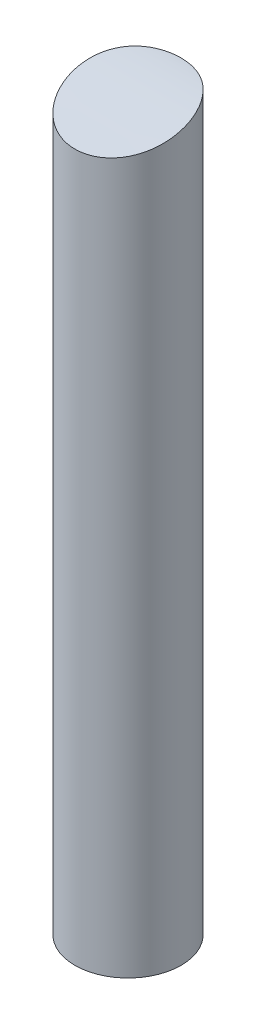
ISO-10303-21;
HEADER;
FILE_DESCRIPTION(('STEP AP214'),'2;1');
FILE_NAME('part.step','',(''),(''),'','','');
FILE_SCHEMA(('AUTOMOTIVE_DESIGN { 1 0 10303 214 1 1 1 1 }'));
ENDSEC;
DATA;
#1=APPLICATION_CONTEXT('core data for automotive mechanical design processes');
#2=APPLICATION_PROTOCOL_DEFINITION('international standard','automotive_design',2000,#1);
#3=PRODUCT_CONTEXT('',#1,'mechanical');
#4=PRODUCT('Part','Part','',(#3));
#5=PRODUCT_RELATED_PRODUCT_CATEGORY('part','',(#4));
#6=PRODUCT_DEFINITION_FORMATION('','',#4);
#7=PRODUCT_DEFINITION_CONTEXT('part definition',#1,'design');
#8=PRODUCT_DEFINITION('design','',#6,#7);
#9=PRODUCT_DEFINITION_SHAPE('','',#8);
#10=(LENGTH_UNIT() NAMED_UNIT(*) SI_UNIT(.MILLI.,.METRE.));
#11=(NAMED_UNIT(*) PLANE_ANGLE_UNIT() SI_UNIT($,.RADIAN.));
#12=(NAMED_UNIT(*) SI_UNIT($,.STERADIAN.) SOLID_ANGLE_UNIT());
#13=UNCERTAINTY_MEASURE_WITH_UNIT(LENGTH_MEASURE(1.E-05),#10,'distance_accuracy_value','');
#14=(GEOMETRIC_REPRESENTATION_CONTEXT(3) GLOBAL_UNCERTAINTY_ASSIGNED_CONTEXT((#13)) GLOBAL_UNIT_ASSIGNED_CONTEXT((#10,
#11,#12)) REPRESENTATION_CONTEXT('',''));
#15=CARTESIAN_POINT('',(0.,0.,0.));
#16=DIRECTION('',(0.,0.,1.));
#17=DIRECTION('',(1.,0.,0.));
#18=AXIS2_PLACEMENT_3D('',#15,#16,#17);
#19=CARTESIAN_POINT('',(0.,15.,0.));
#20=DIRECTION('',(0.,-1.,0.));
#21=DIRECTION('',(0.,0.,-1.));
#22=AXIS2_PLACEMENT_3D('',#19,#20,#21);
#23=CYLINDRICAL_SURFACE('',#22,1.);
#24=CARTESIAN_POINT('',(0.,13.7894850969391,-1.));
#25=CARTESIAN_POINT('',(0.0560713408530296,13.7894883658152,-0.999997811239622));
#26=CARTESIAN_POINT('',(0.112173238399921,13.7896945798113,-0.99526919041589));
#27=CARTESIAN_POINT('',(0.222832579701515,13.7901983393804,-0.976473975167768));
#28=CARTESIAN_POINT('',(0.27738837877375,13.7904959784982,-0.962397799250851));
#29=CARTESIAN_POINT('',(0.383381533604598,13.7903457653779,-0.925294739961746));
#30=CARTESIAN_POINT('',(0.434818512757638,13.789897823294,-0.902266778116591));
#31=CARTESIAN_POINT('',(0.53305421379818,13.7872726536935,-0.847939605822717));
#32=CARTESIAN_POINT('',(0.579854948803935,13.7850961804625,-0.816644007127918));
#33=CARTESIAN_POINT('',(0.666905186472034,13.7782599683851,-0.747194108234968));
#34=CARTESIAN_POINT('',(0.707228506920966,13.7736312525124,-0.709129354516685));
#35=CARTESIAN_POINT('',(0.78086200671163,13.7615178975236,-0.62712908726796));
#36=CARTESIAN_POINT('',(0.814172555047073,13.7540334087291,-0.583193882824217));
#37=CARTESIAN_POINT('',(0.872411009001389,13.7363988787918,-0.491718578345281));
#38=CARTESIAN_POINT('',(0.897479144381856,13.7262992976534,-0.444257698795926));
#39=CARTESIAN_POINT('',(0.939585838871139,13.7037278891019,-0.346433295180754));
#40=CARTESIAN_POINT('',(0.956622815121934,13.6912555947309,-0.296069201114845));
#41=CARTESIAN_POINT('',(0.982935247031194,13.6640181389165,-0.191904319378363));
#42=CARTESIAN_POINT('',(0.991909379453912,13.6491866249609,-0.138045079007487));
#43=CARTESIAN_POINT('',(1.00103232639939,13.618289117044,-0.0298339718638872));
#44=CARTESIAN_POINT('',(1.00116331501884,13.6022206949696,0.0245186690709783));
#45=CARTESIAN_POINT('',(0.992404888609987,13.5686213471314,0.135784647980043));
#46=CARTESIAN_POINT('',(0.982950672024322,13.5510618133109,0.192645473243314));
#47=CARTESIAN_POINT('',(0.954423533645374,13.5163665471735,0.303923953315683));
#48=CARTESIAN_POINT('',(0.935366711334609,13.499230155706,0.358345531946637));
#49=CARTESIAN_POINT('',(0.887502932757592,13.465798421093,0.464544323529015));
#50=CARTESIAN_POINT('',(0.858495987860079,13.4495289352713,0.516239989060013));
#51=CARTESIAN_POINT('',(0.791466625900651,13.418968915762,0.614080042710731));
#52=CARTESIAN_POINT('',(0.753446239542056,13.4046779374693,0.660225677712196));
#53=CARTESIAN_POINT('',(0.670892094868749,13.3791014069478,0.743791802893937));
#54=CARTESIAN_POINT('',(0.626647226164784,13.3677250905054,0.781469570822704));
#55=CARTESIAN_POINT('',(0.531889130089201,13.3476447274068,0.848804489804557));
#56=CARTESIAN_POINT('',(0.481377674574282,13.3389399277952,0.878463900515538));
#57=CARTESIAN_POINT('',(0.378207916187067,13.3247301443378,0.927393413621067));
#58=CARTESIAN_POINT('',(0.325775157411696,13.3190895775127,0.947100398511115));
#59=CARTESIAN_POINT('',(0.218155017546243,13.3104383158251,0.977513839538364));
#60=CARTESIAN_POINT('',(0.162968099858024,13.3074271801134,0.988221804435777));
#61=CARTESIAN_POINT('',(0.0530491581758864,13.3040958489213,1.00007869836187));
#62=CARTESIAN_POINT('',(-0.00165320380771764,13.3037035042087,1.00148391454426));
#63=CARTESIAN_POINT('',(-0.110514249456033,13.3054189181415,0.995368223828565));
#64=CARTESIAN_POINT('',(-0.164672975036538,13.3075264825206,0.987848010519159));
#65=CARTESIAN_POINT('',(-0.270555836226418,13.3142123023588,0.964221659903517));
#66=CARTESIAN_POINT('',(-0.322293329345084,13.3187746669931,0.948170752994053));
#67=CARTESIAN_POINT('',(-0.42227308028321,13.3303239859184,0.908067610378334));
#68=CARTESIAN_POINT('',(-0.470515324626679,13.3373109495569,0.884015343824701));
#69=CARTESIAN_POINT('',(-0.562734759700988,13.3537011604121,0.828408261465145));
#70=CARTESIAN_POINT('',(-0.606659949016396,13.3631298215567,0.796774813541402));
#71=CARTESIAN_POINT('',(-0.688557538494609,13.3841654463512,0.727171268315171));
#72=CARTESIAN_POINT('',(-0.726529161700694,13.395772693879,0.689200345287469));
#73=CARTESIAN_POINT('',(-0.796782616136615,13.4212439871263,0.606764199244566));
#74=CARTESIAN_POINT('',(-0.828845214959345,13.435168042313,0.562130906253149));
#75=CARTESIAN_POINT('',(-0.885096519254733,13.4645075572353,0.468598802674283));
#76=CARTESIAN_POINT('',(-0.909283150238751,13.4799234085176,0.41969887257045));
#77=CARTESIAN_POINT('',(-0.950311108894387,13.5124053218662,0.316450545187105));
#78=CARTESIAN_POINT('',(-0.966743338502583,13.5295150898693,0.261953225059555));
#79=CARTESIAN_POINT('',(-0.990178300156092,13.5639407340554,0.150912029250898));
#80=CARTESIAN_POINT('',(-0.997161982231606,13.5812569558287,0.0943642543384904));
#81=CARTESIAN_POINT('',(-1.00150088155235,13.6157596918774,-0.0212185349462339));
#82=CARTESIAN_POINT('',(-0.998526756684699,13.6329225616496,-0.0802735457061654));
#83=CARTESIAN_POINT('',(-0.982119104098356,13.6654832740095,-0.19729085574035));
#84=CARTESIAN_POINT('',(-0.968707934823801,13.6808848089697,-0.255255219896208));
#85=CARTESIAN_POINT('',(-0.932008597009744,13.7087111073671,-0.367062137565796));
#86=CARTESIAN_POINT('',(-0.908973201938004,13.7212001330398,-0.420971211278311));
#87=CARTESIAN_POINT('',(-0.85349260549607,13.743045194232,-0.524393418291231));
#88=CARTESIAN_POINT('',(-0.821052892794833,13.7524030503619,-0.573909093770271));
#89=CARTESIAN_POINT('',(-0.749998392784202,13.767268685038,-0.663754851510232));
#90=CARTESIAN_POINT('',(-0.711913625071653,13.7729850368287,-0.704470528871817));
#91=CARTESIAN_POINT('',(-0.629325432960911,13.7817223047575,-0.779132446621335));
#92=CARTESIAN_POINT('',(-0.584821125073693,13.7847428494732,-0.813077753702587));
#93=CARTESIAN_POINT('',(-0.491852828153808,13.7886955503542,-0.87238207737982));
#94=CARTESIAN_POINT('',(-0.443508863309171,13.789675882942,-0.897926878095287));
#95=CARTESIAN_POINT('',(-0.343328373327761,13.7905615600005,-0.940792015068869));
#96=CARTESIAN_POINT('',(-0.291494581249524,13.790467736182,-0.958118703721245));
#97=CARTESIAN_POINT('',(-0.199616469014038,13.7901108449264,-0.980698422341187));
#98=CARTESIAN_POINT('',(-0.160044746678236,13.7898986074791,-0.987926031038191));
#99=CARTESIAN_POINT('',(-0.0803205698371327,13.789584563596,-0.997577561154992));
#100=CARTESIAN_POINT('',(-0.0401681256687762,13.7894827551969,-1.00000156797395));
#101=CARTESIAN_POINT('',(0.,13.7894850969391,-1.));
#102=B_SPLINE_CURVE_WITH_KNOTS('',3,(#24,#25,#26,#27,#28,#29,#30,#31,#32,#33,#34,#35,#36,#37,
#38,#39,#40,#41,#42,#43,#44,#45,#46,#47,#48,#49,#50,#51,#52,#53,#54,#55,#56,#57,#58,#59,#60,#61,
#62,#63,#64,#65,#66,#67,#68,#69,#70,#71,#72,#73,#74,#75,#76,#77,#78,#79,#80,#81,#82,#83,#84,#85,
#86,#87,#88,#89,#90,#91,#92,#93,#94,#95,#96,#97,#98,#99,#100,#101),.UNSPECIFIED.,.T.,.F.,(4,2,2,
2,2,2,2,2,2,2,2,2,2,2,2,2,2,2,2,2,2,2,2,2,2,2,2,2,2,2,2,2,2,2,2,2,2,2,4),(0.,0.168069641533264,
0.336311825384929,0.504574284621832,0.672763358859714,0.838873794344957,1.00497548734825,
1.16808423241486,1.33122511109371,1.50023594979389,1.66958746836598,1.849533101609,
2.02917804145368,2.21266865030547,2.39611795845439,2.57286151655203,2.7495552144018,
2.91761408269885,3.08564476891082,3.24902629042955,3.41239511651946,3.5747189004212,
3.73704331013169,3.90113035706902,4.06523880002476,4.23456383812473,4.40393343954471,
4.581446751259,4.7593174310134,4.94312829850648,5.12654648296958,5.3054232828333,
5.4841958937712,5.65149346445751,5.81881408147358,5.98213665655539,6.14533278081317,
6.26573586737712,6.3861368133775),.UNSPECIFIED.);
#103=CARTESIAN_POINT('',(0.,13.7894850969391,-1.));
#104=VERTEX_POINT('',#103);
#105=EDGE_CURVE('E37',#104,#104,#102,.T.);
#106=ORIENTED_EDGE('',*,*,#105,.T.);
#107=EDGE_LOOP('',(#106));
#108=FACE_BOUND('',#107,.T.);
#109=CARTESIAN_POINT('',(0.,0.,0.));
#110=DIRECTION('',(0.,1.,0.));
#111=DIRECTION('',(0.,0.,1.));
#112=AXIS2_PLACEMENT_3D('',#109,#110,#111);
#113=CIRCLE('',#112,1.);
#114=CARTESIAN_POINT('',(0.,0.,1.));
#115=VERTEX_POINT('',#114);
#116=EDGE_CURVE('E10',#115,#115,#113,.T.);
#117=ORIENTED_EDGE('',*,*,#116,.T.);
#118=EDGE_LOOP('',(#117));
#119=FACE_BOUND('',#118,.T.);
#120=ADVANCED_FACE('F33',(#108,#119),#23,.T.);
#121=CARTESIAN_POINT('',(0.,0.,0.));
#122=DIRECTION('',(0.,1.,0.));
#123=DIRECTION('',(0.,0.,1.));
#124=AXIS2_PLACEMENT_3D('',#121,#122,#123);
#125=PLANE('',#124);
#126=ORIENTED_EDGE('',*,*,#116,.F.);
#127=EDGE_LOOP('',(#126));
#128=FACE_BOUND('',#127,.T.);
#129=ADVANCED_FACE('F58',(#128),#125,.F.);
#130=CARTESIAN_POINT('',(-2.5,13.5623663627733,4.450407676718));
#131=CARTESIAN_POINT('',(-2.5,12.335876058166,1.64700126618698));
#132=CARTESIAN_POINT('',(-2.5,13.597408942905,0.700851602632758));
#133=CARTESIAN_POINT('',(-2.5,14.4033882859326,-1.54187352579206));
#134=CARTESIAN_POINT('',(-2.5,13.3170683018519,-1.54187352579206));
#135=B_SPLINE_CURVE_WITH_KNOTS('',4,(#130,#131,#132,#133,#134),.UNSPECIFIED.,.F.,.F.,(5,5),(0.,
1.),.UNSPECIFIED.);
#136=DIRECTION('',(1.,0.,0.));
#137=VECTOR('',#136,1.);
#138=SURFACE_OF_LINEAR_EXTRUSION('',#135,#137);
#139=ORIENTED_EDGE('',*,*,#105,.F.);
#140=EDGE_LOOP('',(#139));
#141=FACE_BOUND('',#140,.T.);
#142=ADVANCED_FACE('F55',(#141),#138,.F.);
#143=CLOSED_SHELL('',(#120,#129,#142));
#144=MANIFOLD_SOLID_BREP('B2',#143);
#145=ADVANCED_BREP_SHAPE_REPRESENTATION('',(#18,#144),#14);
#146=SHAPE_DEFINITION_REPRESENTATION(#9,#145);
ENDSEC;
END-ISO-10303-21;
